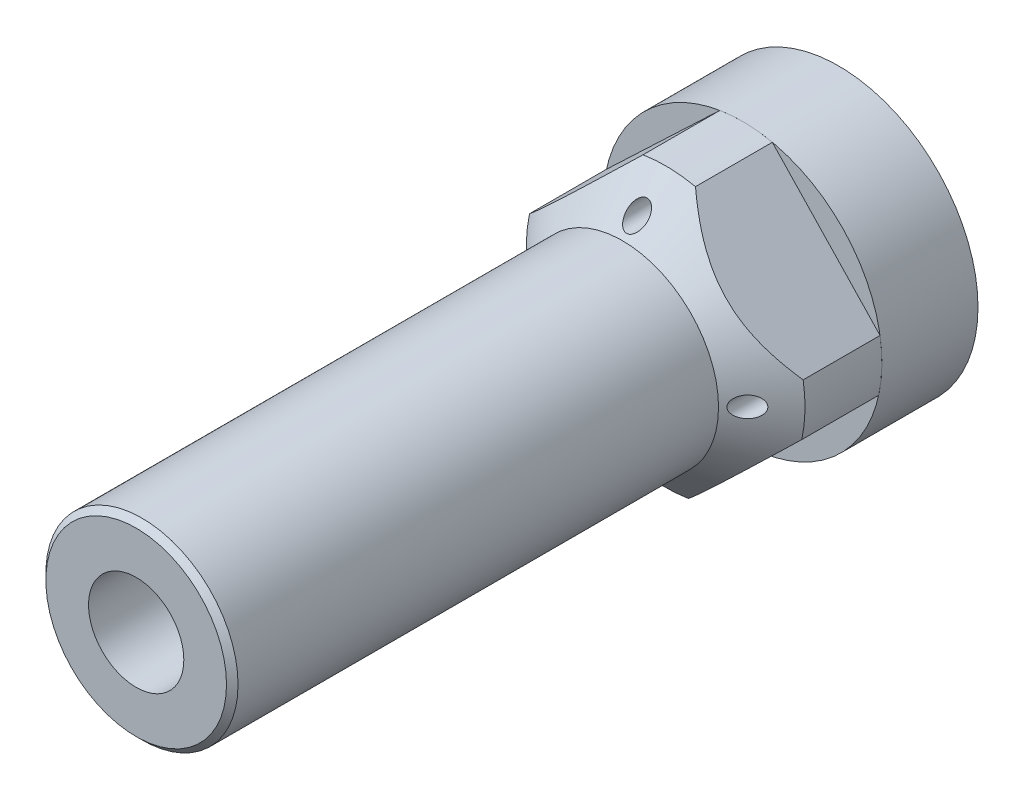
from build123d import *

# Parameters (mm, degrees)
SKETCH4_W          = 3.556
SKETCH4_H          = 1.905
CIRPATTERN1_COUNT  = 4
CIRPATTERN2_COUNT  = 4
CUT_EXTRUDE1_START = -19.05
CUT_EXTRUDE1_DEPTH = 104.312466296
CIRPATTERN3_COUNT  = 4


with BuildPart() as part:
    # Sketch2 → Revolve1 (revolve)
    with BuildSketch(Plane(origin=(0, 0, 0), x_dir=(0, 0, -1), z_dir=(1, 0, 0)), mode=Mode.PRIVATE) as revolve1_sk:
        Polygon((69.977, 18.415), (80.137, 18.415), (80.137, 6.3754), (12.77874, 6.3754), (12.7, 6.29666), (0, 6.29666), (0, 11.938), (0.762, 12.7), (64.262, 12.7), align=None)
    revolve(revolve1_sk.sketch.rotate(Axis((0, 0, 0), (0, 0, -1)), 90), axis=Axis((0, 0, 0), (0, 0, -1)))

    # Sketch8 → 6-32 Tapped Hole1 (revolve, cut)
    with BuildSketch(Plane(origin=(0, 14.605, -80.137), x_dir=(0, 1, 0), z_dir=(1, 0, 0))):
        Polygon((0, 0), (0, 16.33209403), (1.35255, 15.5194), (1.35255, 0), align=None)
    f_6_32_tapped_hole1 = revolve(axis=Axis((0, 14.605, -86.487), (0, 0, 1)), mode=Mode.SUBTRACT)

    # CirPattern2: 6-32 Tapped Hole1 ×4 about axis
    cirpattern2_axis = Axis((0, 0, 0), (0, 0, 1))
    for i in range(1, CIRPATTERN2_COUNT):
        add(f_6_32_tapped_hole1.rotate(cirpattern2_axis, i * 360 / CIRPATTERN2_COUNT), mode=Mode.SUBTRACT)

    # Sketch9 → Cut-Extrude1 (cut)
    with BuildSketch(Plane(origin=(0, 0, -80.137), x_dir=(-1, 0, 0), z_dir=(0, 0, -1)).offset(CUT_EXTRUDE1_START)):
        Polygon((-83.872001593, -66.226712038), (-18.169946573, 2.994205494), (-3.937254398, 17.989170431), (61.764800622, 87.210087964), (-76.677034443, 218.614198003), (-222.313836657, 65.177398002), align=None)
    cut_extrude1 = extrude(amount=CUT_EXTRUDE1_DEPTH, mode=Mode.SUBTRACT)

    # CirPattern3: Cut-Extrude1 ×4 about axis
    cirpattern3_axis = Axis((0, 0, 0), (0, 0, -1))
    for i in range(1, CIRPATTERN3_COUNT):
        add(cut_extrude1.rotate(cirpattern3_axis, i * 360 / CIRPATTERN3_COUNT), mode=Mode.SUBTRACT)


with BuildPart() as body_2:
    # Sketch3 → Revolve2 (revolve)
    with BuildSketch(Plane(origin=(0, 0, 0), x_dir=(0, 0, -1), z_dir=(1, 0, 0)), mode=Mode.PRIVATE) as revolve2_sk:
        Polygon((63.5, 6.35), (63.5, 0), (92.837, 0), (92.837, 18.415), (80.137, 18.415), (80.137, 6.35), align=None)
    revolve(revolve2_sk.sketch.rotate(Axis((0, 0, 0), (0, 0, -1)), 90), axis=Axis((0, 0, 0), (0, 0, -1)))

    # Sketch4 → Cut-Revolve1 (revolve, cut)
    with BuildSketch(Plane(origin=(0, 0, 0), x_dir=(0, 0, -1), z_dir=(1, 0, 0)), mode=Mode.PRIVATE) as cut_revolve1_sk:
        with Locations((75.184, 5.3975)):
            Rectangle(SKETCH4_W, SKETCH4_H)
        with Locations((68.453, 5.3975)):
            Rectangle(SKETCH4_W, SKETCH4_H)
    revolve(cut_revolve1_sk.sketch.rotate(Axis((0, 0, 0), (0, 0, -1)), 90), axis=Axis((0, 0, 0), (0, 0, -1)), mode=Mode.SUBTRACT)

    # Sketch6 → 6 Clearance Hole1 (revolve, cut)
    with BuildSketch(Plane(origin=(0, 14.605, -92.837), x_dir=(0, 1, 0), z_dir=(1, 0, 0))):
        Polygon((0, 0), (0, 16.660224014), (1.89865, 15.5194), (1.89865, 0), align=None)
    f_6_clearance_hole1 = revolve(axis=Axis((0, 14.605, -99.187), (0, 0, 1)), mode=Mode.SUBTRACT)

    # CirPattern1: 6 Clearance Hole1 ×4 about axis
    cirpattern1_axis = Axis((0, 0, 0), (0, 0, 1))
    for i in range(1, CIRPATTERN1_COUNT):
        add(f_6_clearance_hole1.rotate(cirpattern1_axis, i * 360 / CIRPATTERN1_COUNT), mode=Mode.SUBTRACT)


solid = Compound([part.part, body_2.part])
